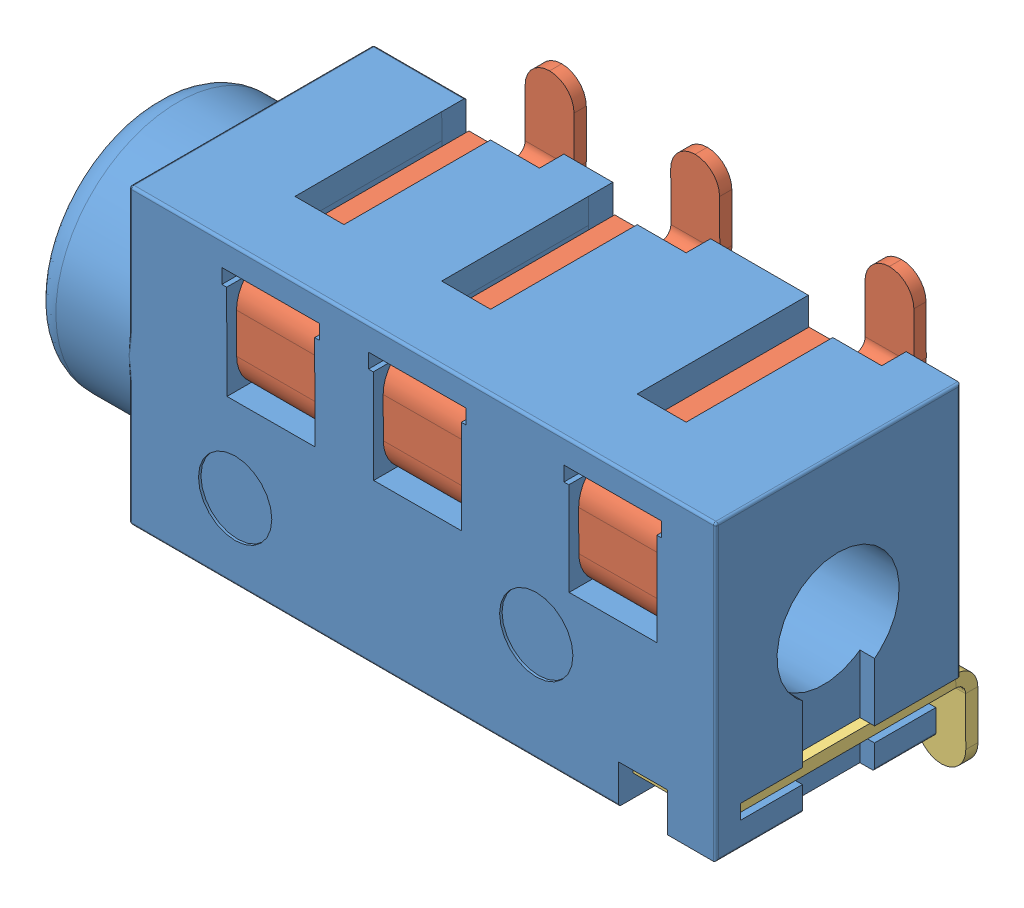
SolidWorks assembly PJ320D.SLDASM, configuration 默认 (file format 11000). Lengths in mm.
Overall size (14 8.29 6).
5 component instances, 3 part files, 8 mates.
Components (placement in the parent):
- PJ320A-1: PJ320A.SLDPRT [默认] at (0.6927 0.3146 12) size (14 6 6)
- PJ320D-Pin-1: PJ320D-Pin.SLDPRT [默认] at (-1.4086 2.5032 9.986) x (0 0 1) z (0 -1 0) size (5.25 1.95 4.01)
- PJ320D-Pin-3: PJ320D-Pin.SLDPRT [默认] at (1.5746 2.5146 9.986) x (0 0 1) z (0.003937 -0.999992 0) size (5.25 1.95 4.01)
- PJ320D-Pin-6: PJ320D-Pin.SLDPRT [默认] at (5.5478 2.5134 9.986) x (0 0 1) z (0.003937 -0.999992 0) size (5.25 1.95 4.01)
- PJ320D-Pin-B-1: PJ320D-Pin-B.SLDPRT [默认] at (6.5995 -2.1358 12) x (0 0 1) z (0.003937 -0.999992 0) size (5.25 1.8 1.94)
Mates (geometry in assembly coordinates):
- 重合4: coincident: plane of PJ320A-1 through (0.6927 0.3146 12) normal (0 0 -1); plane of PJ320D-Pin-1 through (-2.4086 2.7532 12) normal (0 0 -1)
- 重合11: coincident: plane of PJ320A-1 through (0.6927 0.3146 12) normal (0 0 -1); plane of PJ320D-Pin-3 through (0.5736 2.7607 12) normal (0 0 -1)
- 重合16: coincident: plane of PJ320A-1 through (0.6927 0.3146 12) normal (0 0 -1); plane of PJ320D-Pin-B-1 through (5.5985 -1.8897 12) normal (0 0 -1)
- 重合19: coincident: plane of PJ320A-1 through (0.6927 0.3146 12) normal (0 0 -1); plane of PJ320D-Pin-6 through (4.5468 2.7595 12) normal (0 0 -1)
- 重合20: coincident: plane of PJ320A-1 through (-2.4072 2.5032 15.5) normal (0 1 0); plane of PJ320D-Pin-1 through (-1.4086 2.5032 9.986) normal (0 -1 0)
- 重合21: coincident: plane of PJ320A-1 through (1.584 2.5146 17) normal (-0.003937 0.999992 0); plane of PJ320D-Pin-3 through (1.5746 2.5146 9.986) normal (0.003937 -0.999992 0)
- 重合22: coincident: plane of PJ320A-1 through (5.584 2.5136 17) normal (-0.003937 0.999992 0); plane of PJ320D-Pin-6 through (5.5478 2.5134 9.986) normal (0.003937 -0.999992 0)
- 重合27: coincident: plane of PJ320A-1 through (6.7014 -1.8854 12.5) normal (0.003937 -0.999992 0); plane of PJ320D-Pin-B-1 through (6.5985 -1.8858 12) normal (-0.003937 0.999992 0)
